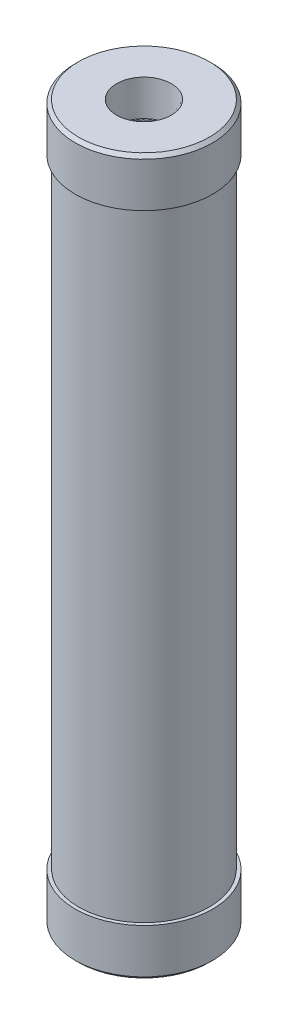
ISO-10303-21;
HEADER;
FILE_DESCRIPTION(('STEP AP214'),'2;1');
FILE_NAME('part.step','',(''),(''),'','','');
FILE_SCHEMA(('AUTOMOTIVE_DESIGN { 1 0 10303 214 1 1 1 1 }'));
ENDSEC;
DATA;
#1=APPLICATION_CONTEXT('core data for automotive mechanical design processes');
#2=APPLICATION_PROTOCOL_DEFINITION('international standard','automotive_design',2000,#1);
#3=PRODUCT_CONTEXT('',#1,'mechanical');
#4=PRODUCT('Part','Part','',(#3));
#5=PRODUCT_RELATED_PRODUCT_CATEGORY('part','',(#4));
#6=PRODUCT_DEFINITION_FORMATION('','',#4);
#7=PRODUCT_DEFINITION_CONTEXT('part definition',#1,'design');
#8=PRODUCT_DEFINITION('design','',#6,#7);
#9=PRODUCT_DEFINITION_SHAPE('','',#8);
#10=(LENGTH_UNIT() NAMED_UNIT(*) SI_UNIT(.MILLI.,.METRE.));
#11=(NAMED_UNIT(*) PLANE_ANGLE_UNIT() SI_UNIT($,.RADIAN.));
#12=(NAMED_UNIT(*) SI_UNIT($,.STERADIAN.) SOLID_ANGLE_UNIT());
#13=UNCERTAINTY_MEASURE_WITH_UNIT(LENGTH_MEASURE(1.E-05),#10,'distance_accuracy_value','');
#14=(GEOMETRIC_REPRESENTATION_CONTEXT(3) GLOBAL_UNCERTAINTY_ASSIGNED_CONTEXT((#13)) GLOBAL_UNIT_ASSIGNED_CONTEXT((#10,
#11,#12)) REPRESENTATION_CONTEXT('',''));
#15=CARTESIAN_POINT('',(0.,0.,0.));
#16=DIRECTION('',(0.,0.,1.));
#17=DIRECTION('',(1.,0.,0.));
#18=AXIS2_PLACEMENT_3D('',#15,#16,#17);
#19=CARTESIAN_POINT('',(0.,330.2,0.));
#20=DIRECTION('',(0.,-1.,0.));
#21=DIRECTION('',(0.,0.,-1.));
#22=AXIS2_PLACEMENT_3D('',#19,#20,#21);
#23=CYLINDRICAL_SURFACE('',#22,30.1625);
#24=CARTESIAN_POINT('',(0.,22.098,0.));
#25=DIRECTION('',(0.,1.,0.));
#26=DIRECTION('',(0.,0.,1.));
#27=AXIS2_PLACEMENT_3D('',#24,#25,#26);
#28=CIRCLE('',#27,30.1625);
#29=CARTESIAN_POINT('',(0.,22.098,30.1625));
#30=VERTEX_POINT('',#29);
#31=EDGE_CURVE('E82',#30,#30,#28,.T.);
#32=ORIENTED_EDGE('',*,*,#31,.T.);
#33=EDGE_LOOP('',(#32));
#34=FACE_BOUND('',#33,.T.);
#35=CARTESIAN_POINT('',(0.,308.102,0.));
#36=DIRECTION('',(0.,1.,0.));
#37=DIRECTION('',(0.,0.,1.));
#38=AXIS2_PLACEMENT_3D('',#35,#36,#37);
#39=CIRCLE('',#38,30.1625);
#40=CARTESIAN_POINT('',(0.,308.102,30.1625));
#41=VERTEX_POINT('',#40);
#42=EDGE_CURVE('E61',#41,#41,#39,.T.);
#43=ORIENTED_EDGE('',*,*,#42,.F.);
#44=EDGE_LOOP('',(#43));
#45=FACE_BOUND('',#44,.T.);
#46=ADVANCED_FACE('F33',(#34,#45),#23,.T.);
#47=CARTESIAN_POINT('',(0.,330.2,0.));
#48=DIRECTION('',(0.,-1.,0.));
#49=DIRECTION('',(0.,0.,-1.));
#50=AXIS2_PLACEMENT_3D('',#47,#48,#49);
#51=CYLINDRICAL_SURFACE('',#50,25.9969);
#52=CARTESIAN_POINT('',(0.,22.098,0.));
#53=DIRECTION('',(0.,1.,0.));
#54=DIRECTION('',(0.,0.,1.));
#55=AXIS2_PLACEMENT_3D('',#52,#53,#54);
#56=CIRCLE('',#55,25.9969);
#57=CARTESIAN_POINT('',(0.,22.098,25.9969));
#58=VERTEX_POINT('',#57);
#59=EDGE_CURVE('E53',#58,#58,#56,.T.);
#60=ORIENTED_EDGE('',*,*,#59,.F.);
#61=EDGE_LOOP('',(#60));
#62=FACE_BOUND('',#61,.T.);
#63=CARTESIAN_POINT('',(0.,308.102,0.));
#64=DIRECTION('',(0.,1.,0.));
#65=DIRECTION('',(0.,0.,1.));
#66=AXIS2_PLACEMENT_3D('',#63,#64,#65);
#67=CIRCLE('',#66,25.9969);
#68=CARTESIAN_POINT('',(0.,308.102,25.9969));
#69=VERTEX_POINT('',#68);
#70=EDGE_CURVE('E67',#69,#69,#67,.T.);
#71=ORIENTED_EDGE('',*,*,#70,.T.);
#72=EDGE_LOOP('',(#71));
#73=FACE_BOUND('',#72,.T.);
#74=ADVANCED_FACE('F117',(#62,#73),#51,.F.);
#75=CARTESIAN_POINT('',(0.,308.102,0.));
#76=DIRECTION('',(0.,1.,0.));
#77=DIRECTION('',(0.,0.,1.));
#78=AXIS2_PLACEMENT_3D('',#75,#76,#77);
#79=PLANE('',#78);
#80=CARTESIAN_POINT('',(0.,308.102,0.));
#81=DIRECTION('',(0.,1.,0.));
#82=DIRECTION('',(0.,0.,1.));
#83=AXIS2_PLACEMENT_3D('',#80,#81,#82);
#84=CIRCLE('',#83,11.5);
#85=CARTESIAN_POINT('',(0.,308.102,11.5));
#86=VERTEX_POINT('',#85);
#87=EDGE_CURVE('E62',#86,#86,#84,.T.);
#88=ORIENTED_EDGE('',*,*,#87,.T.);
#89=EDGE_LOOP('',(#88));
#90=FACE_BOUND('',#89,.T.);
#91=ORIENTED_EDGE('',*,*,#70,.F.);
#92=EDGE_LOOP('',(#91));
#93=FACE_BOUND('',#92,.T.);
#94=ADVANCED_FACE('F122',(#90,#93),#79,.F.);
#95=CARTESIAN_POINT('',(0.,308.102,0.));
#96=DIRECTION('',(0.,1.,0.));
#97=DIRECTION('',(0.,0.,1.));
#98=AXIS2_PLACEMENT_3D('',#95,#96,#97);
#99=CIRCLE('',#98,31.75);
#100=CARTESIAN_POINT('',(0.,308.102,31.75));
#101=VERTEX_POINT('',#100);
#102=EDGE_CURVE('E65',#101,#101,#99,.T.);
#103=ORIENTED_EDGE('',*,*,#102,.F.);
#104=EDGE_LOOP('',(#103));
#105=FACE_BOUND('',#104,.T.);
#106=ORIENTED_EDGE('',*,*,#42,.T.);
#107=EDGE_LOOP('',(#106));
#108=FACE_BOUND('',#107,.T.);
#109=ADVANCED_FACE('F168',(#105,#108),#79,.F.);
#110=CARTESIAN_POINT('',(0.,308.102,0.));
#111=DIRECTION('',(0.,1.,0.));
#112=DIRECTION('',(0.,0.,1.));
#113=AXIS2_PLACEMENT_3D('',#110,#111,#112);
#114=CYLINDRICAL_SURFACE('',#113,31.75);
#115=CARTESIAN_POINT('',(0.,328.676,0.));
#116=DIRECTION('',(0.,1.,0.));
#117=DIRECTION('',(0.,0.,1.));
#118=AXIS2_PLACEMENT_3D('',#115,#116,#117);
#119=CIRCLE('',#118,31.75);
#120=CARTESIAN_POINT('',(0.,328.676,31.75));
#121=VERTEX_POINT('',#120);
#122=EDGE_CURVE('E10',#121,#121,#119,.F.);
#123=ORIENTED_EDGE('',*,*,#122,.T.);
#124=EDGE_LOOP('',(#123));
#125=FACE_BOUND('',#124,.T.);
#126=ORIENTED_EDGE('',*,*,#102,.T.);
#127=EDGE_LOOP('',(#126));
#128=FACE_BOUND('',#127,.T.);
#129=ADVANCED_FACE('F170',(#125,#128),#114,.T.);
#130=CARTESIAN_POINT('',(0.,330.2,0.));
#131=DIRECTION('',(0.,1.,0.));
#132=DIRECTION('',(0.,0.,1.));
#133=AXIS2_PLACEMENT_3D('',#130,#131,#132);
#134=PLANE('',#133);
#135=CARTESIAN_POINT('',(0.,330.2,0.));
#136=DIRECTION('',(0.,1.,0.));
#137=DIRECTION('',(0.,0.,1.));
#138=AXIS2_PLACEMENT_3D('',#135,#136,#137);
#139=CIRCLE('',#138,30.226);
#140=CARTESIAN_POINT('',(0.,330.2,30.226));
#141=VERTEX_POINT('',#140);
#142=EDGE_CURVE('E40',#141,#141,#139,.T.);
#143=ORIENTED_EDGE('',*,*,#142,.T.);
#144=EDGE_LOOP('',(#143));
#145=FACE_BOUND('',#144,.T.);
#146=CARTESIAN_POINT('',(0.,330.2,0.));
#147=DIRECTION('',(0.,1.,0.));
#148=DIRECTION('',(0.,0.,1.));
#149=AXIS2_PLACEMENT_3D('',#146,#147,#148);
#150=CIRCLE('',#149,12.6381265);
#151=CARTESIAN_POINT('',(0.,330.2,12.6381265));
#152=VERTEX_POINT('',#151);
#153=EDGE_CURVE('E79',#152,#152,#150,.T.);
#154=ORIENTED_EDGE('',*,*,#153,.F.);
#155=EDGE_LOOP('',(#154));
#156=FACE_BOUND('',#155,.T.);
#157=ADVANCED_FACE('F164',(#145,#156),#134,.T.);
#158=CARTESIAN_POINT('',(0.,330.2,0.));
#159=DIRECTION('',(0.,1.,0.));
#160=DIRECTION('',(0.,0.,1.));
#161=AXIS2_PLACEMENT_3D('',#158,#159,#160);
#162=CYLINDRICAL_SURFACE('',#161,11.5);
#163=CARTESIAN_POINT('',(0.,313.944,0.));
#164=DIRECTION('',(0.,1.,0.));
#165=DIRECTION('',(0.,0.,1.));
#166=AXIS2_PLACEMENT_3D('',#163,#164,#165);
#167=CIRCLE('',#166,11.5);
#168=CARTESIAN_POINT('',(0.,313.944,11.5));
#169=VERTEX_POINT('',#168);
#170=EDGE_CURVE('E66',#169,#169,#167,.T.);
#171=ORIENTED_EDGE('',*,*,#170,.T.);
#172=EDGE_LOOP('',(#171));
#173=FACE_BOUND('',#172,.T.);
#174=ORIENTED_EDGE('',*,*,#87,.F.);
#175=EDGE_LOOP('',(#174));
#176=FACE_BOUND('',#175,.T.);
#177=ADVANCED_FACE('F160',(#173,#176),#162,.F.);
#178=CARTESIAN_POINT('',(11.5,313.944,0.));
#179=DIRECTION('',(0.,-1.,0.));
#180=DIRECTION('',(0.,0.,-1.));
#181=AXIS2_PLACEMENT_3D('',#178,#179,#180);
#182=PLANE('',#181);
#183=ORIENTED_EDGE('',*,*,#170,.F.);
#184=EDGE_LOOP('',(#183));
#185=FACE_BOUND('',#184,.T.);
#186=CARTESIAN_POINT('',(0.,313.944,0.));
#187=DIRECTION('',(0.,1.,0.));
#188=DIRECTION('',(0.,0.,1.));
#189=AXIS2_PLACEMENT_3D('',#186,#187,#188);
#190=CIRCLE('',#189,12.1306691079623);
#191=CARTESIAN_POINT('',(0.,313.944,12.1306691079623));
#192=VERTEX_POINT('',#191);
#193=EDGE_CURVE('E76',#192,#192,#190,.T.);
#194=ORIENTED_EDGE('',*,*,#193,.T.);
#195=EDGE_LOOP('',(#194));
#196=FACE_BOUND('',#195,.T.);
#197=ADVANCED_FACE('F156',(#185,#196),#182,.F.);
#198=CARTESIAN_POINT('',(0.,330.2,0.));
#199=DIRECTION('',(0.,1.,0.));
#200=DIRECTION('',(0.,0.,1.));
#201=AXIS2_PLACEMENT_3D('',#198,#199,#200);
#202=CONICAL_SURFACE('',#201,12.6381265,0.0312064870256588);
#203=ORIENTED_EDGE('',*,*,#193,.F.);
#204=EDGE_LOOP('',(#203));
#205=FACE_BOUND('',#204,.T.);
#206=ORIENTED_EDGE('',*,*,#153,.T.);
#207=EDGE_LOOP('',(#206));
#208=FACE_BOUND('',#207,.T.);
#209=ADVANCED_FACE('F150',(#205,#208),#202,.F.);
#210=CARTESIAN_POINT('',(0.,22.098,0.));
#211=DIRECTION('',(0.,1.,0.));
#212=DIRECTION('',(0.,0.,1.));
#213=AXIS2_PLACEMENT_3D('',#210,#211,#212);
#214=PLANE('',#213);
#215=CARTESIAN_POINT('',(0.,22.098,0.));
#216=DIRECTION('',(0.,1.,0.));
#217=DIRECTION('',(0.,0.,1.));
#218=AXIS2_PLACEMENT_3D('',#215,#216,#217);
#219=CIRCLE('',#218,11.5);
#220=CARTESIAN_POINT('',(0.,22.098,11.5));
#221=VERTEX_POINT('',#220);
#222=EDGE_CURVE('E54',#221,#221,#219,.T.);
#223=ORIENTED_EDGE('',*,*,#222,.F.);
#224=EDGE_LOOP('',(#223));
#225=FACE_BOUND('',#224,.T.);
#226=ORIENTED_EDGE('',*,*,#59,.T.);
#227=EDGE_LOOP('',(#226));
#228=FACE_BOUND('',#227,.T.);
#229=ADVANCED_FACE('F144',(#225,#228),#214,.T.);
#230=CARTESIAN_POINT('',(0.,22.098,0.));
#231=DIRECTION('',(0.,1.,0.));
#232=DIRECTION('',(0.,0.,1.));
#233=AXIS2_PLACEMENT_3D('',#230,#231,#232);
#234=CIRCLE('',#233,31.75);
#235=CARTESIAN_POINT('',(0.,22.098,31.75));
#236=VERTEX_POINT('',#235);
#237=EDGE_CURVE('E57',#236,#236,#234,.T.);
#238=ORIENTED_EDGE('',*,*,#237,.T.);
#239=EDGE_LOOP('',(#238));
#240=FACE_BOUND('',#239,.T.);
#241=ORIENTED_EDGE('',*,*,#31,.F.);
#242=EDGE_LOOP('',(#241));
#243=FACE_BOUND('',#242,.T.);
#244=ADVANCED_FACE('F111',(#240,#243),#214,.T.);
#245=CARTESIAN_POINT('',(0.,22.098,0.));
#246=DIRECTION('',(0.,-1.,0.));
#247=DIRECTION('',(0.,0.,-1.));
#248=AXIS2_PLACEMENT_3D('',#245,#246,#247);
#249=CYLINDRICAL_SURFACE('',#248,31.75);
#250=CARTESIAN_POINT('',(0.,1.524,0.));
#251=DIRECTION('',(0.,1.,0.));
#252=DIRECTION('',(0.,0.,1.));
#253=AXIS2_PLACEMENT_3D('',#250,#251,#252);
#254=CIRCLE('',#253,31.75);
#255=CARTESIAN_POINT('',(0.,1.524,31.75));
#256=VERTEX_POINT('',#255);
#257=EDGE_CURVE('E48',#256,#256,#254,.T.);
#258=ORIENTED_EDGE('',*,*,#257,.T.);
#259=EDGE_LOOP('',(#258));
#260=FACE_BOUND('',#259,.T.);
#261=ORIENTED_EDGE('',*,*,#237,.F.);
#262=EDGE_LOOP('',(#261));
#263=FACE_BOUND('',#262,.T.);
#264=ADVANCED_FACE('F101',(#260,#263),#249,.T.);
#265=CARTESIAN_POINT('',(0.,0.,0.));
#266=DIRECTION('',(0.,1.,0.));
#267=DIRECTION('',(0.,0.,1.));
#268=AXIS2_PLACEMENT_3D('',#265,#266,#267);
#269=PLANE('',#268);
#270=CARTESIAN_POINT('',(0.,0.,0.));
#271=DIRECTION('',(0.,1.,0.));
#272=DIRECTION('',(0.,0.,1.));
#273=AXIS2_PLACEMENT_3D('',#270,#271,#272);
#274=CIRCLE('',#273,30.226);
#275=CARTESIAN_POINT('',(0.,0.,30.226));
#276=VERTEX_POINT('',#275);
#277=EDGE_CURVE('E44',#276,#276,#274,.F.);
#278=ORIENTED_EDGE('',*,*,#277,.T.);
#279=EDGE_LOOP('',(#278));
#280=FACE_BOUND('',#279,.T.);
#281=CARTESIAN_POINT('',(0.,0.,0.));
#282=DIRECTION('',(0.,-1.,0.));
#283=DIRECTION('',(0.,0.,-1.));
#284=AXIS2_PLACEMENT_3D('',#281,#282,#283);
#285=CIRCLE('',#284,12.6381265);
#286=CARTESIAN_POINT('',(0.,0.,-12.6381265));
#287=VERTEX_POINT('',#286);
#288=EDGE_CURVE('E92',#287,#287,#285,.T.);
#289=ORIENTED_EDGE('',*,*,#288,.F.);
#290=EDGE_LOOP('',(#289));
#291=FACE_BOUND('',#290,.T.);
#292=ADVANCED_FACE('F98',(#280,#291),#269,.F.);
#293=CARTESIAN_POINT('',(0.,0.,0.));
#294=DIRECTION('',(0.,-1.,0.));
#295=DIRECTION('',(0.,0.,-1.));
#296=AXIS2_PLACEMENT_3D('',#293,#294,#295);
#297=CYLINDRICAL_SURFACE('',#296,11.5);
#298=ORIENTED_EDGE('',*,*,#222,.T.);
#299=EDGE_LOOP('',(#298));
#300=FACE_BOUND('',#299,.T.);
#301=CARTESIAN_POINT('',(0.,16.256,0.));
#302=DIRECTION('',(0.,-1.,0.));
#303=DIRECTION('',(0.,0.,-1.));
#304=AXIS2_PLACEMENT_3D('',#301,#302,#303);
#305=CIRCLE('',#304,11.5);
#306=CARTESIAN_POINT('',(0.,16.256,-11.5));
#307=VERTEX_POINT('',#306);
#308=EDGE_CURVE('E58',#307,#307,#305,.T.);
#309=ORIENTED_EDGE('',*,*,#308,.T.);
#310=EDGE_LOOP('',(#309));
#311=FACE_BOUND('',#310,.T.);
#312=ADVANCED_FACE('F100',(#300,#311),#297,.F.);
#313=CARTESIAN_POINT('',(11.5,16.256,0.));
#314=DIRECTION('',(0.,1.,0.));
#315=DIRECTION('',(0.,0.,1.));
#316=AXIS2_PLACEMENT_3D('',#313,#314,#315);
#317=PLANE('',#316);
#318=ORIENTED_EDGE('',*,*,#308,.F.);
#319=EDGE_LOOP('',(#318));
#320=FACE_BOUND('',#319,.T.);
#321=CARTESIAN_POINT('',(0.,16.256,0.));
#322=DIRECTION('',(0.,-1.,0.));
#323=DIRECTION('',(0.,0.,-1.));
#324=AXIS2_PLACEMENT_3D('',#321,#322,#323);
#325=CIRCLE('',#324,12.1306691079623);
#326=CARTESIAN_POINT('',(0.,16.256,-12.1306691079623));
#327=VERTEX_POINT('',#326);
#328=EDGE_CURVE('E89',#327,#327,#325,.T.);
#329=ORIENTED_EDGE('',*,*,#328,.T.);
#330=EDGE_LOOP('',(#329));
#331=FACE_BOUND('',#330,.T.);
#332=ADVANCED_FACE('F108',(#320,#331),#317,.F.);
#333=CARTESIAN_POINT('',(0.,0.,0.));
#334=DIRECTION('',(0.,-1.,0.));
#335=DIRECTION('',(0.,0.,-1.));
#336=AXIS2_PLACEMENT_3D('',#333,#334,#335);
#337=CONICAL_SURFACE('',#336,12.6381265,0.0312064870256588);
#338=ORIENTED_EDGE('',*,*,#328,.F.);
#339=EDGE_LOOP('',(#338));
#340=FACE_BOUND('',#339,.T.);
#341=ORIENTED_EDGE('',*,*,#288,.T.);
#342=EDGE_LOOP('',(#341));
#343=FACE_BOUND('',#342,.T.);
#344=ADVANCED_FACE('F96',(#340,#343),#337,.F.);
#345=CARTESIAN_POINT('',(0.,1.524,0.));
#346=DIRECTION('',(0.,1.,0.));
#347=DIRECTION('',(0.,0.,1.));
#348=AXIS2_PLACEMENT_3D('',#345,#346,#347);
#349=CONICAL_SURFACE('',#348,31.75,0.785398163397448);
#350=ORIENTED_EDGE('',*,*,#277,.F.);
#351=EDGE_LOOP('',(#350));
#352=FACE_BOUND('',#351,.T.);
#353=ORIENTED_EDGE('',*,*,#257,.F.);
#354=EDGE_LOOP('',(#353));
#355=FACE_BOUND('',#354,.T.);
#356=ADVANCED_FACE('F126',(#352,#355),#349,.T.);
#357=CARTESIAN_POINT('',(0.,330.2,0.));
#358=DIRECTION('',(0.,-1.,0.));
#359=DIRECTION('',(0.,0.,-1.));
#360=AXIS2_PLACEMENT_3D('',#357,#358,#359);
#361=CONICAL_SURFACE('',#360,30.226,0.78539816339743);
#362=ORIENTED_EDGE('',*,*,#122,.F.);
#363=EDGE_LOOP('',(#362));
#364=FACE_BOUND('',#363,.T.);
#365=ORIENTED_EDGE('',*,*,#142,.F.);
#366=EDGE_LOOP('',(#365));
#367=FACE_BOUND('',#366,.T.);
#368=ADVANCED_FACE('F35',(#364,#367),#361,.T.);
#369=CLOSED_SHELL('',(#46,#74,#94,#109,#129,#157,#177,#197,#209,#229,#244,#264,#292,#312,#332,
#344,#356,#368));
#370=MANIFOLD_SOLID_BREP('B2',#369);
#371=ADVANCED_BREP_SHAPE_REPRESENTATION('',(#18,#370),#14);
#372=SHAPE_DEFINITION_REPRESENTATION(#9,#371);
ENDSEC;
END-ISO-10303-21;
